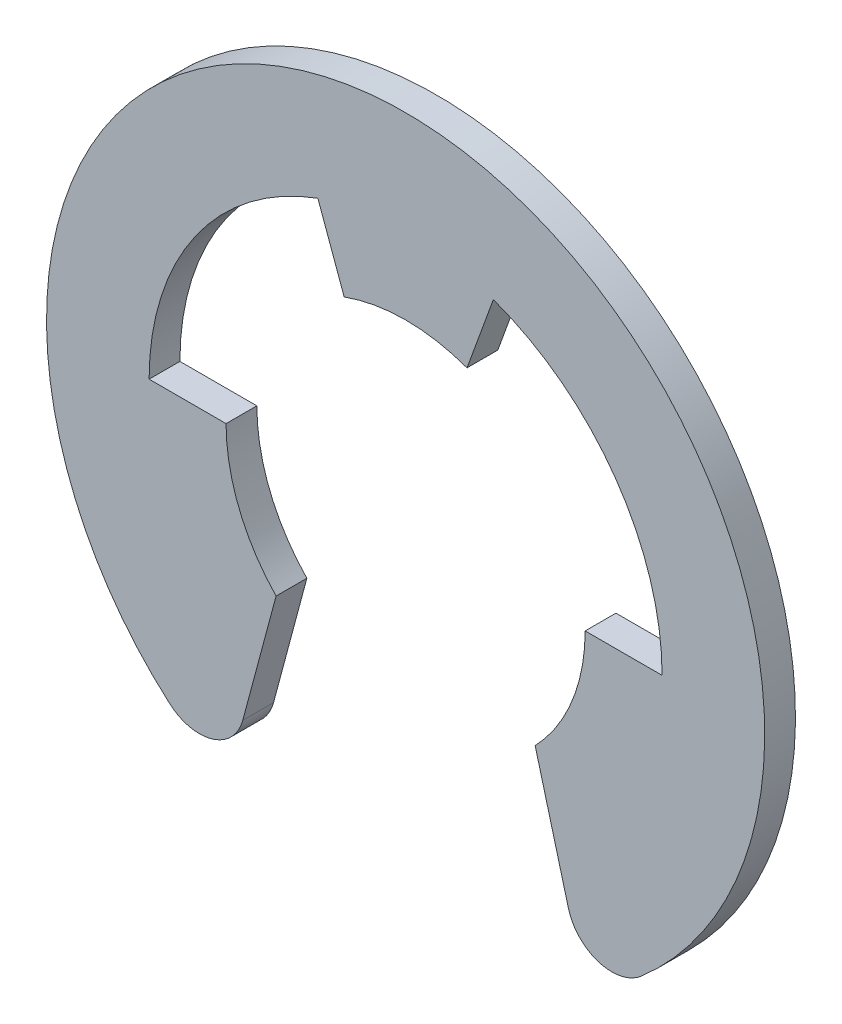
ISO-10303-21;
HEADER;
FILE_DESCRIPTION(('STEP AP214'),'2;1');
FILE_NAME('part.step','',(''),(''),'','','');
FILE_SCHEMA(('AUTOMOTIVE_DESIGN { 1 0 10303 214 1 1 1 1 }'));
ENDSEC;
DATA;
#1=APPLICATION_CONTEXT('core data for automotive mechanical design processes');
#2=APPLICATION_PROTOCOL_DEFINITION('international standard','automotive_design',2000,#1);
#3=PRODUCT_CONTEXT('',#1,'mechanical');
#4=PRODUCT('Part','Part','',(#3));
#5=PRODUCT_RELATED_PRODUCT_CATEGORY('part','',(#4));
#6=PRODUCT_DEFINITION_FORMATION('','',#4);
#7=PRODUCT_DEFINITION_CONTEXT('part definition',#1,'design');
#8=PRODUCT_DEFINITION('design','',#6,#7);
#9=PRODUCT_DEFINITION_SHAPE('','',#8);
#10=(LENGTH_UNIT() NAMED_UNIT(*) SI_UNIT(.MILLI.,.METRE.));
#11=(NAMED_UNIT(*) PLANE_ANGLE_UNIT() SI_UNIT($,.RADIAN.));
#12=(NAMED_UNIT(*) SI_UNIT($,.STERADIAN.) SOLID_ANGLE_UNIT());
#13=UNCERTAINTY_MEASURE_WITH_UNIT(LENGTH_MEASURE(1.E-05),#10,'distance_accuracy_value','');
#14=(GEOMETRIC_REPRESENTATION_CONTEXT(3) GLOBAL_UNCERTAINTY_ASSIGNED_CONTEXT((#13)) GLOBAL_UNIT_ASSIGNED_CONTEXT((#10,
#11,#12)) REPRESENTATION_CONTEXT('',''));
#15=CARTESIAN_POINT('',(0.,0.,0.));
#16=DIRECTION('',(0.,0.,1.));
#17=DIRECTION('',(1.,0.,0.));
#18=AXIS2_PLACEMENT_3D('',#15,#16,#17);
#19=CARTESIAN_POINT('',(0.,0.,0.6));
#20=DIRECTION('',(0.,0.,-1.));
#21=DIRECTION('',(-1.,0.,0.));
#22=AXIS2_PLACEMENT_3D('',#19,#20,#21);
#23=CYLINDRICAL_SURFACE('',#22,5.);
#24=CARTESIAN_POINT('',(0.,0.,0.));
#25=DIRECTION('',(0.,0.,-1.));
#26=DIRECTION('',(1.,0.,0.));
#27=AXIS2_PLACEMENT_3D('',#24,#25,#26);
#28=CIRCLE('',#27,5.);
#29=CARTESIAN_POINT('',(1.71010071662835,4.69846310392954,0.));
#30=VERTEX_POINT('',#29);
#31=CARTESIAN_POINT('',(5.,0.,0.));
#32=VERTEX_POINT('',#31);
#33=EDGE_CURVE('E136',#30,#32,#28,.T.);
#34=ORIENTED_EDGE('',*,*,#33,.T.);
#35=DIRECTION('',(0.,0.,-1.));
#36=VECTOR('',#35,1.);
#37=CARTESIAN_POINT('',(5.,0.,0.6));
#38=LINE('',#37,#36);
#39=CARTESIAN_POINT('',(5.,0.,0.6));
#40=VERTEX_POINT('',#39);
#41=EDGE_CURVE('E11',#40,#32,#38,.T.);
#42=ORIENTED_EDGE('',*,*,#41,.F.);
#43=CARTESIAN_POINT('',(0.,0.,0.6));
#44=DIRECTION('',(0.,0.,-1.));
#45=DIRECTION('',(1.,0.,0.));
#46=AXIS2_PLACEMENT_3D('',#43,#44,#45);
#47=CIRCLE('',#46,5.);
#48=CARTESIAN_POINT('',(1.71010071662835,4.69846310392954,0.6));
#49=VERTEX_POINT('',#48);
#50=EDGE_CURVE('E175',#49,#40,#47,.T.);
#51=ORIENTED_EDGE('',*,*,#50,.F.);
#52=DIRECTION('',(0.,0.,-1.));
#53=VECTOR('',#52,1.);
#54=CARTESIAN_POINT('',(1.71010071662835,4.69846310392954,0.6));
#55=LINE('',#54,#53);
#56=EDGE_CURVE('E149',#49,#30,#55,.T.);
#57=ORIENTED_EDGE('',*,*,#56,.T.);
#58=EDGE_LOOP('',(#34,#42,#51,#57));
#59=FACE_BOUND('',#58,.T.);
#60=ADVANCED_FACE('F32',(#59),#23,.F.);
#61=CARTESIAN_POINT('',(3.5,0.,0.6));
#62=DIRECTION('',(0.,-1.,0.));
#63=DIRECTION('',(0.,0.,-1.));
#64=AXIS2_PLACEMENT_3D('',#61,#62,#63);
#65=PLANE('',#64);
#66=DIRECTION('',(-1.,0.,0.));
#67=VECTOR('',#66,1.);
#68=CARTESIAN_POINT('',(3.5,0.,0.));
#69=LINE('',#68,#67);
#70=CARTESIAN_POINT('',(3.5,0.,0.));
#71=VERTEX_POINT('',#70);
#72=EDGE_CURVE('E132',#32,#71,#69,.T.);
#73=ORIENTED_EDGE('',*,*,#72,.T.);
#74=DIRECTION('',(0.,0.,-1.));
#75=VECTOR('',#74,1.);
#76=CARTESIAN_POINT('',(3.5,0.,0.6));
#77=LINE('',#76,#75);
#78=CARTESIAN_POINT('',(3.5,0.,0.6));
#79=VERTEX_POINT('',#78);
#80=EDGE_CURVE('E39',#79,#71,#77,.T.);
#81=ORIENTED_EDGE('',*,*,#80,.F.);
#82=DIRECTION('',(-1.,0.,0.));
#83=VECTOR('',#82,1.);
#84=CARTESIAN_POINT('',(3.5,0.,0.6));
#85=LINE('',#84,#83);
#86=EDGE_CURVE('E145',#40,#79,#85,.T.);
#87=ORIENTED_EDGE('',*,*,#86,.F.);
#88=ORIENTED_EDGE('',*,*,#41,.T.);
#89=EDGE_LOOP('',(#73,#81,#87,#88));
#90=FACE_BOUND('',#89,.T.);
#91=ADVANCED_FACE('F144',(#90),#65,.F.);
#92=CARTESIAN_POINT('',(0.,0.,0.6));
#93=DIRECTION('',(0.,0.,-1.));
#94=DIRECTION('',(-1.,0.,0.));
#95=AXIS2_PLACEMENT_3D('',#92,#93,#94);
#96=CYLINDRICAL_SURFACE('',#95,3.5);
#97=CARTESIAN_POINT('',(0.,0.,0.));
#98=DIRECTION('',(0.,0.,-1.));
#99=DIRECTION('',(1.,0.,0.));
#100=AXIS2_PLACEMENT_3D('',#97,#98,#99);
#101=CIRCLE('',#100,3.5);
#102=CARTESIAN_POINT('',(2.52505922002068,-2.4236493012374,0.));
#103=VERTEX_POINT('',#102);
#104=EDGE_CURVE('E138',#71,#103,#101,.T.);
#105=ORIENTED_EDGE('',*,*,#104,.T.);
#106=DIRECTION('',(0.,0.,-1.));
#107=VECTOR('',#106,1.);
#108=CARTESIAN_POINT('',(2.52505922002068,-2.4236493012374,0.6));
#109=LINE('',#108,#107);
#110=CARTESIAN_POINT('',(2.52505922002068,-2.4236493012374,0.6));
#111=VERTEX_POINT('',#110);
#112=EDGE_CURVE('E231',#111,#103,#109,.T.);
#113=ORIENTED_EDGE('',*,*,#112,.F.);
#114=CARTESIAN_POINT('',(0.,0.,0.6));
#115=DIRECTION('',(0.,0.,-1.));
#116=DIRECTION('',(1.,0.,0.));
#117=AXIS2_PLACEMENT_3D('',#114,#115,#116);
#118=CIRCLE('',#117,3.5);
#119=EDGE_CURVE('E178',#79,#111,#118,.T.);
#120=ORIENTED_EDGE('',*,*,#119,.F.);
#121=ORIENTED_EDGE('',*,*,#80,.T.);
#122=EDGE_LOOP('',(#105,#113,#120,#121));
#123=FACE_BOUND('',#122,.T.);
#124=ADVANCED_FACE('F235',(#123),#96,.F.);
#125=CARTESIAN_POINT('',(2.52505922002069,-2.4236493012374,0.6));
#126=DIRECTION('',(0.965925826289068,0.258819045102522,0.));
#127=DIRECTION('',(-0.258819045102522,0.965925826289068,0.));
#128=AXIS2_PLACEMENT_3D('',#125,#126,#127);
#129=PLANE('',#128);
#130=DIRECTION('',(0.258819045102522,-0.965925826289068,0.));
#131=VECTOR('',#130,1.);
#132=CARTESIAN_POINT('',(2.52505922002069,-2.4236493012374,0.));
#133=LINE('',#132,#131);
#134=CARTESIAN_POINT('',(3.17461227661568,-4.84781431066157,0.));
#135=VERTEX_POINT('',#134);
#136=EDGE_CURVE('E153',#103,#135,#133,.T.);
#137=ORIENTED_EDGE('',*,*,#136,.T.);
#138=DIRECTION('',(0.,0.,-1.));
#139=VECTOR('',#138,1.);
#140=CARTESIAN_POINT('',(3.17461227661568,-4.84781431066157,0.6));
#141=LINE('',#140,#139);
#142=CARTESIAN_POINT('',(3.17461227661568,-4.84781431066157,0.6));
#143=VERTEX_POINT('',#142);
#144=EDGE_CURVE('E228',#143,#135,#141,.T.);
#145=ORIENTED_EDGE('',*,*,#144,.F.);
#146=DIRECTION('',(0.258819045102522,-0.965925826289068,0.));
#147=VECTOR('',#146,1.);
#148=CARTESIAN_POINT('',(2.52505922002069,-2.4236493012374,0.6));
#149=LINE('',#148,#147);
#150=EDGE_CURVE('E180',#111,#143,#149,.T.);
#151=ORIENTED_EDGE('',*,*,#150,.F.);
#152=ORIENTED_EDGE('',*,*,#112,.T.);
#153=EDGE_LOOP('',(#137,#145,#151,#152));
#154=FACE_BOUND('',#153,.T.);
#155=ADVANCED_FACE('F243',(#154),#129,.F.);
#156=CARTESIAN_POINT('',(4.01979737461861,-4.62134764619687,0.6));
#157=DIRECTION('',(0.,0.,-1.));
#158=DIRECTION('',(-1.,0.,0.));
#159=AXIS2_PLACEMENT_3D('',#156,#157,#158);
#160=CYLINDRICAL_SURFACE('',#159,0.874999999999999);
#161=CARTESIAN_POINT('',(4.01979737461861,-4.62134764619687,0.));
#162=DIRECTION('',(0.,0.,1.));
#163=DIRECTION('',(1.,0.,0.));
#164=AXIS2_PLACEMENT_3D('',#161,#162,#163);
#165=CIRCLE('',#164,0.874999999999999);
#166=CARTESIAN_POINT('',(4.59405414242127,-5.28154016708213,0.));
#167=VERTEX_POINT('',#166);
#168=EDGE_CURVE('E155',#135,#167,#165,.T.);
#169=ORIENTED_EDGE('',*,*,#168,.T.);
#170=DIRECTION('',(0.,0.,-1.));
#171=VECTOR('',#170,1.);
#172=CARTESIAN_POINT('',(4.59405414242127,-5.28154016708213,0.6));
#173=LINE('',#172,#171);
#174=CARTESIAN_POINT('',(4.59405414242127,-5.28154016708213,0.6));
#175=VERTEX_POINT('',#174);
#176=EDGE_CURVE('E225',#175,#167,#173,.T.);
#177=ORIENTED_EDGE('',*,*,#176,.F.);
#178=CARTESIAN_POINT('',(4.01979737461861,-4.62134764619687,0.6));
#179=DIRECTION('',(0.,0.,1.));
#180=DIRECTION('',(1.,0.,0.));
#181=AXIS2_PLACEMENT_3D('',#178,#179,#180);
#182=CIRCLE('',#181,0.874999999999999);
#183=EDGE_CURVE('E182',#143,#175,#182,.T.);
#184=ORIENTED_EDGE('',*,*,#183,.F.);
#185=ORIENTED_EDGE('',*,*,#144,.T.);
#186=EDGE_LOOP('',(#169,#177,#184,#185));
#187=FACE_BOUND('',#186,.T.);
#188=ADVANCED_FACE('F246',(#187),#160,.T.);
#189=CARTESIAN_POINT('',(0.,0.,0.6));
#190=DIRECTION('',(0.,0.,-1.));
#191=DIRECTION('',(-1.,0.,0.));
#192=AXIS2_PLACEMENT_3D('',#189,#190,#191);
#193=CYLINDRICAL_SURFACE('',#192,7.);
#194=CARTESIAN_POINT('',(0.,0.,0.));
#195=DIRECTION('',(0.,0.,1.));
#196=DIRECTION('',(1.,0.,0.));
#197=AXIS2_PLACEMENT_3D('',#194,#195,#196);
#198=CIRCLE('',#197,7.);
#199=CARTESIAN_POINT('',(-4.59405414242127,-5.28154016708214,0.));
#200=VERTEX_POINT('',#199);
#201=EDGE_CURVE('E157',#167,#200,#198,.T.);
#202=ORIENTED_EDGE('',*,*,#201,.T.);
#203=DIRECTION('',(0.,0.,-1.));
#204=VECTOR('',#203,1.);
#205=CARTESIAN_POINT('',(-4.59405414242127,-5.28154016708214,0.6));
#206=LINE('',#205,#204);
#207=CARTESIAN_POINT('',(-4.59405414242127,-5.28154016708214,0.6));
#208=VERTEX_POINT('',#207);
#209=EDGE_CURVE('E222',#208,#200,#206,.T.);
#210=ORIENTED_EDGE('',*,*,#209,.F.);
#211=CARTESIAN_POINT('',(0.,0.,0.6));
#212=DIRECTION('',(0.,0.,1.));
#213=DIRECTION('',(1.,0.,0.));
#214=AXIS2_PLACEMENT_3D('',#211,#212,#213);
#215=CIRCLE('',#214,7.);
#216=EDGE_CURVE('E184',#175,#208,#215,.T.);
#217=ORIENTED_EDGE('',*,*,#216,.F.);
#218=ORIENTED_EDGE('',*,*,#176,.T.);
#219=EDGE_LOOP('',(#202,#210,#217,#218));
#220=FACE_BOUND('',#219,.T.);
#221=ADVANCED_FACE('F251',(#220),#193,.T.);
#222=CARTESIAN_POINT('',(-4.01979737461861,-4.62134764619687,0.6));
#223=DIRECTION('',(0.,0.,-1.));
#224=DIRECTION('',(-1.,0.,0.));
#225=AXIS2_PLACEMENT_3D('',#222,#223,#224);
#226=CYLINDRICAL_SURFACE('',#225,0.875);
#227=CARTESIAN_POINT('',(-4.01979737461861,-4.62134764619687,0.));
#228=DIRECTION('',(0.,0.,1.));
#229=DIRECTION('',(1.,0.,0.));
#230=AXIS2_PLACEMENT_3D('',#227,#228,#229);
#231=CIRCLE('',#230,0.875);
#232=CARTESIAN_POINT('',(-3.17461227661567,-4.84781431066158,0.));
#233=VERTEX_POINT('',#232);
#234=EDGE_CURVE('E159',#200,#233,#231,.T.);
#235=ORIENTED_EDGE('',*,*,#234,.T.);
#236=DIRECTION('',(0.,0.,-1.));
#237=VECTOR('',#236,1.);
#238=CARTESIAN_POINT('',(-3.17461227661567,-4.84781431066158,0.6));
#239=LINE('',#238,#237);
#240=CARTESIAN_POINT('',(-3.17461227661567,-4.84781431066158,0.6));
#241=VERTEX_POINT('',#240);
#242=EDGE_CURVE('E219',#241,#233,#239,.T.);
#243=ORIENTED_EDGE('',*,*,#242,.F.);
#244=CARTESIAN_POINT('',(-4.01979737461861,-4.62134764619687,0.6));
#245=DIRECTION('',(0.,0.,1.));
#246=DIRECTION('',(1.,0.,0.));
#247=AXIS2_PLACEMENT_3D('',#244,#245,#246);
#248=CIRCLE('',#247,0.875);
#249=EDGE_CURVE('E186',#208,#241,#248,.T.);
#250=ORIENTED_EDGE('',*,*,#249,.F.);
#251=ORIENTED_EDGE('',*,*,#209,.T.);
#252=EDGE_LOOP('',(#235,#243,#250,#251));
#253=FACE_BOUND('',#252,.T.);
#254=ADVANCED_FACE('F257',(#253),#226,.T.);
#255=CARTESIAN_POINT('',(-2.52505922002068,-2.4236493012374,0.6));
#256=DIRECTION('',(-0.965925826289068,0.258819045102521,0.));
#257=DIRECTION('',(-0.258819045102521,-0.965925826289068,0.));
#258=AXIS2_PLACEMENT_3D('',#255,#256,#257);
#259=PLANE('',#258);
#260=DIRECTION('',(0.258819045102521,0.965925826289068,0.));
#261=VECTOR('',#260,1.);
#262=CARTESIAN_POINT('',(-2.52505922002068,-2.4236493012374,0.));
#263=LINE('',#262,#261);
#264=CARTESIAN_POINT('',(-2.52505922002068,-2.4236493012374,0.));
#265=VERTEX_POINT('',#264);
#266=EDGE_CURVE('E161',#233,#265,#263,.T.);
#267=ORIENTED_EDGE('',*,*,#266,.T.);
#268=DIRECTION('',(0.,0.,-1.));
#269=VECTOR('',#268,1.);
#270=CARTESIAN_POINT('',(-2.52505922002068,-2.4236493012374,0.6));
#271=LINE('',#270,#269);
#272=CARTESIAN_POINT('',(-2.52505922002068,-2.4236493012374,0.6));
#273=VERTEX_POINT('',#272);
#274=EDGE_CURVE('E216',#273,#265,#271,.T.);
#275=ORIENTED_EDGE('',*,*,#274,.F.);
#276=DIRECTION('',(0.258819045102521,0.965925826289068,0.));
#277=VECTOR('',#276,1.);
#278=CARTESIAN_POINT('',(-2.52505922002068,-2.4236493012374,0.6));
#279=LINE('',#278,#277);
#280=EDGE_CURVE('E188',#241,#273,#279,.T.);
#281=ORIENTED_EDGE('',*,*,#280,.F.);
#282=ORIENTED_EDGE('',*,*,#242,.T.);
#283=EDGE_LOOP('',(#267,#275,#281,#282));
#284=FACE_BOUND('',#283,.T.);
#285=ADVANCED_FACE('F261',(#284),#259,.F.);
#286=CARTESIAN_POINT('',(0.,0.,0.6));
#287=DIRECTION('',(0.,0.,-1.));
#288=DIRECTION('',(-1.,0.,0.));
#289=AXIS2_PLACEMENT_3D('',#286,#287,#288);
#290=CYLINDRICAL_SURFACE('',#289,3.5);
#291=CARTESIAN_POINT('',(0.,0.,0.));
#292=DIRECTION('',(0.,0.,-1.));
#293=DIRECTION('',(1.,0.,0.));
#294=AXIS2_PLACEMENT_3D('',#291,#292,#293);
#295=CIRCLE('',#294,3.5);
#296=CARTESIAN_POINT('',(-3.5,0.,0.));
#297=VERTEX_POINT('',#296);
#298=EDGE_CURVE('E163',#265,#297,#295,.T.);
#299=ORIENTED_EDGE('',*,*,#298,.T.);
#300=DIRECTION('',(0.,0.,-1.));
#301=VECTOR('',#300,1.);
#302=CARTESIAN_POINT('',(-3.5,0.,0.6));
#303=LINE('',#302,#301);
#304=CARTESIAN_POINT('',(-3.5,0.,0.6));
#305=VERTEX_POINT('',#304);
#306=EDGE_CURVE('E213',#305,#297,#303,.T.);
#307=ORIENTED_EDGE('',*,*,#306,.F.);
#308=CARTESIAN_POINT('',(0.,0.,0.6));
#309=DIRECTION('',(0.,0.,-1.));
#310=DIRECTION('',(1.,0.,0.));
#311=AXIS2_PLACEMENT_3D('',#308,#309,#310);
#312=CIRCLE('',#311,3.5);
#313=EDGE_CURVE('E190',#273,#305,#312,.T.);
#314=ORIENTED_EDGE('',*,*,#313,.F.);
#315=ORIENTED_EDGE('',*,*,#274,.T.);
#316=EDGE_LOOP('',(#299,#307,#314,#315));
#317=FACE_BOUND('',#316,.T.);
#318=ADVANCED_FACE('F266',(#317),#290,.F.);
#319=CARTESIAN_POINT('',(-5.,0.,0.6));
#320=DIRECTION('',(0.,-1.,0.));
#321=DIRECTION('',(0.,0.,-1.));
#322=AXIS2_PLACEMENT_3D('',#319,#320,#321);
#323=PLANE('',#322);
#324=DIRECTION('',(-1.,0.,0.));
#325=VECTOR('',#324,1.);
#326=CARTESIAN_POINT('',(-5.,0.,0.));
#327=LINE('',#326,#325);
#328=CARTESIAN_POINT('',(-5.,0.,0.));
#329=VERTEX_POINT('',#328);
#330=EDGE_CURVE('E165',#297,#329,#327,.T.);
#331=ORIENTED_EDGE('',*,*,#330,.T.);
#332=DIRECTION('',(0.,0.,-1.));
#333=VECTOR('',#332,1.);
#334=CARTESIAN_POINT('',(-5.,0.,0.6));
#335=LINE('',#334,#333);
#336=CARTESIAN_POINT('',(-5.,0.,0.6));
#337=VERTEX_POINT('',#336);
#338=EDGE_CURVE('E210',#337,#329,#335,.T.);
#339=ORIENTED_EDGE('',*,*,#338,.F.);
#340=DIRECTION('',(-1.,0.,0.));
#341=VECTOR('',#340,1.);
#342=CARTESIAN_POINT('',(-5.,0.,0.6));
#343=LINE('',#342,#341);
#344=EDGE_CURVE('E192',#305,#337,#343,.T.);
#345=ORIENTED_EDGE('',*,*,#344,.F.);
#346=ORIENTED_EDGE('',*,*,#306,.T.);
#347=EDGE_LOOP('',(#331,#339,#345,#346));
#348=FACE_BOUND('',#347,.T.);
#349=ADVANCED_FACE('F272',(#348),#323,.F.);
#350=CARTESIAN_POINT('',(0.,0.,0.6));
#351=DIRECTION('',(0.,0.,-1.));
#352=DIRECTION('',(-1.,0.,0.));
#353=AXIS2_PLACEMENT_3D('',#350,#351,#352);
#354=CYLINDRICAL_SURFACE('',#353,5.);
#355=CARTESIAN_POINT('',(0.,0.,0.));
#356=DIRECTION('',(0.,0.,-1.));
#357=DIRECTION('',(1.,0.,0.));
#358=AXIS2_PLACEMENT_3D('',#355,#356,#357);
#359=CIRCLE('',#358,5.);
#360=CARTESIAN_POINT('',(-1.71010071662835,4.69846310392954,0.));
#361=VERTEX_POINT('',#360);
#362=EDGE_CURVE('E167',#329,#361,#359,.T.);
#363=ORIENTED_EDGE('',*,*,#362,.T.);
#364=DIRECTION('',(0.,0.,-1.));
#365=VECTOR('',#364,1.);
#366=CARTESIAN_POINT('',(-1.71010071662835,4.69846310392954,0.6));
#367=LINE('',#366,#365);
#368=CARTESIAN_POINT('',(-1.71010071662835,4.69846310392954,0.6));
#369=VERTEX_POINT('',#368);
#370=EDGE_CURVE('E207',#369,#361,#367,.T.);
#371=ORIENTED_EDGE('',*,*,#370,.F.);
#372=CARTESIAN_POINT('',(0.,0.,0.6));
#373=DIRECTION('',(0.,0.,-1.));
#374=DIRECTION('',(1.,0.,0.));
#375=AXIS2_PLACEMENT_3D('',#372,#373,#374);
#376=CIRCLE('',#375,5.);
#377=EDGE_CURVE('E194',#337,#369,#376,.T.);
#378=ORIENTED_EDGE('',*,*,#377,.F.);
#379=ORIENTED_EDGE('',*,*,#338,.T.);
#380=EDGE_LOOP('',(#363,#371,#378,#379));
#381=FACE_BOUND('',#380,.T.);
#382=ADVANCED_FACE('F276',(#381),#354,.F.);
#383=CARTESIAN_POINT('',(-1.19707050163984,3.28892417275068,0.6));
#384=DIRECTION('',(0.939692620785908,0.342020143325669,0.));
#385=DIRECTION('',(-0.342020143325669,0.939692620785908,0.));
#386=AXIS2_PLACEMENT_3D('',#383,#384,#385);
#387=PLANE('',#386);
#388=DIRECTION('',(0.342020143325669,-0.939692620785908,0.));
#389=VECTOR('',#388,1.);
#390=CARTESIAN_POINT('',(-1.19707050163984,3.28892417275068,0.));
#391=LINE('',#390,#389);
#392=CARTESIAN_POINT('',(-1.19707050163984,3.28892417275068,0.));
#393=VERTEX_POINT('',#392);
#394=EDGE_CURVE('E169',#361,#393,#391,.T.);
#395=ORIENTED_EDGE('',*,*,#394,.T.);
#396=DIRECTION('',(0.,0.,-1.));
#397=VECTOR('',#396,1.);
#398=CARTESIAN_POINT('',(-1.19707050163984,3.28892417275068,0.6));
#399=LINE('',#398,#397);
#400=CARTESIAN_POINT('',(-1.19707050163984,3.28892417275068,0.6));
#401=VERTEX_POINT('',#400);
#402=EDGE_CURVE('E204',#401,#393,#399,.T.);
#403=ORIENTED_EDGE('',*,*,#402,.F.);
#404=DIRECTION('',(0.342020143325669,-0.939692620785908,0.));
#405=VECTOR('',#404,1.);
#406=CARTESIAN_POINT('',(-1.19707050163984,3.28892417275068,0.6));
#407=LINE('',#406,#405);
#408=EDGE_CURVE('E196',#369,#401,#407,.T.);
#409=ORIENTED_EDGE('',*,*,#408,.F.);
#410=ORIENTED_EDGE('',*,*,#370,.T.);
#411=EDGE_LOOP('',(#395,#403,#409,#410));
#412=FACE_BOUND('',#411,.T.);
#413=ADVANCED_FACE('F281',(#412),#387,.F.);
#414=CARTESIAN_POINT('',(0.,0.,0.6));
#415=DIRECTION('',(0.,0.,-1.));
#416=DIRECTION('',(-1.,0.,0.));
#417=AXIS2_PLACEMENT_3D('',#414,#415,#416);
#418=CYLINDRICAL_SURFACE('',#417,3.5);
#419=CARTESIAN_POINT('',(0.,0.,0.));
#420=DIRECTION('',(0.,0.,-1.));
#421=DIRECTION('',(1.,0.,0.));
#422=AXIS2_PLACEMENT_3D('',#419,#420,#421);
#423=CIRCLE('',#422,3.5);
#424=CARTESIAN_POINT('',(1.19707050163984,3.28892417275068,0.));
#425=VERTEX_POINT('',#424);
#426=EDGE_CURVE('E171',#393,#425,#423,.T.);
#427=ORIENTED_EDGE('',*,*,#426,.T.);
#428=DIRECTION('',(0.,0.,-1.));
#429=VECTOR('',#428,1.);
#430=CARTESIAN_POINT('',(1.19707050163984,3.28892417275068,0.6));
#431=LINE('',#430,#429);
#432=CARTESIAN_POINT('',(1.19707050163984,3.28892417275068,0.6));
#433=VERTEX_POINT('',#432);
#434=EDGE_CURVE('E201',#433,#425,#431,.T.);
#435=ORIENTED_EDGE('',*,*,#434,.F.);
#436=CARTESIAN_POINT('',(0.,0.,0.6));
#437=DIRECTION('',(0.,0.,-1.));
#438=DIRECTION('',(1.,0.,0.));
#439=AXIS2_PLACEMENT_3D('',#436,#437,#438);
#440=CIRCLE('',#439,3.5);
#441=EDGE_CURVE('E51',#401,#433,#440,.T.);
#442=ORIENTED_EDGE('',*,*,#441,.F.);
#443=ORIENTED_EDGE('',*,*,#402,.T.);
#444=EDGE_LOOP('',(#427,#435,#442,#443));
#445=FACE_BOUND('',#444,.T.);
#446=ADVANCED_FACE('F284',(#445),#418,.F.);
#447=CARTESIAN_POINT('',(1.19707050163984,3.28892417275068,0.6));
#448=DIRECTION('',(-0.939692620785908,0.342020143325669,0.));
#449=DIRECTION('',(-0.342020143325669,-0.939692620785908,0.));
#450=AXIS2_PLACEMENT_3D('',#447,#448,#449);
#451=PLANE('',#450);
#452=DIRECTION('',(0.342020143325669,0.939692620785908,0.));
#453=VECTOR('',#452,1.);
#454=CARTESIAN_POINT('',(1.19707050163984,3.28892417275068,0.));
#455=LINE('',#454,#453);
#456=EDGE_CURVE('E173',#425,#30,#455,.T.);
#457=ORIENTED_EDGE('',*,*,#456,.T.);
#458=ORIENTED_EDGE('',*,*,#56,.F.);
#459=DIRECTION('',(0.342020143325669,0.939692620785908,0.));
#460=VECTOR('',#459,1.);
#461=CARTESIAN_POINT('',(1.19707050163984,3.28892417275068,0.6));
#462=LINE('',#461,#460);
#463=EDGE_CURVE('E46',#433,#49,#462,.T.);
#464=ORIENTED_EDGE('',*,*,#463,.F.);
#465=ORIENTED_EDGE('',*,*,#434,.T.);
#466=EDGE_LOOP('',(#457,#458,#464,#465));
#467=FACE_BOUND('',#466,.T.);
#468=ADVANCED_FACE('F286',(#467),#451,.F.);
#469=CARTESIAN_POINT('',(0.,0.,0.6));
#470=DIRECTION('',(0.,0.,1.));
#471=DIRECTION('',(1.,0.,0.));
#472=AXIS2_PLACEMENT_3D('',#469,#470,#471);
#473=PLANE('',#472);
#474=ORIENTED_EDGE('',*,*,#50,.T.);
#475=ORIENTED_EDGE('',*,*,#86,.T.);
#476=ORIENTED_EDGE('',*,*,#119,.T.);
#477=ORIENTED_EDGE('',*,*,#150,.T.);
#478=ORIENTED_EDGE('',*,*,#183,.T.);
#479=ORIENTED_EDGE('',*,*,#216,.T.);
#480=ORIENTED_EDGE('',*,*,#249,.T.);
#481=ORIENTED_EDGE('',*,*,#280,.T.);
#482=ORIENTED_EDGE('',*,*,#313,.T.);
#483=ORIENTED_EDGE('',*,*,#344,.T.);
#484=ORIENTED_EDGE('',*,*,#377,.T.);
#485=ORIENTED_EDGE('',*,*,#408,.T.);
#486=ORIENTED_EDGE('',*,*,#441,.T.);
#487=ORIENTED_EDGE('',*,*,#463,.T.);
#488=EDGE_LOOP('',(#474,#475,#476,#477,#478,#479,#480,#481,#482,#483,#484,#485,#486,#487));
#489=FACE_BOUND('',#488,.T.);
#490=ADVANCED_FACE('F238',(#489),#473,.T.);
#491=CARTESIAN_POINT('',(0.,0.,0.));
#492=DIRECTION('',(0.,0.,1.));
#493=DIRECTION('',(1.,0.,0.));
#494=AXIS2_PLACEMENT_3D('',#491,#492,#493);
#495=PLANE('',#494);
#496=ORIENTED_EDGE('',*,*,#33,.F.);
#497=ORIENTED_EDGE('',*,*,#456,.F.);
#498=ORIENTED_EDGE('',*,*,#426,.F.);
#499=ORIENTED_EDGE('',*,*,#394,.F.);
#500=ORIENTED_EDGE('',*,*,#362,.F.);
#501=ORIENTED_EDGE('',*,*,#330,.F.);
#502=ORIENTED_EDGE('',*,*,#298,.F.);
#503=ORIENTED_EDGE('',*,*,#266,.F.);
#504=ORIENTED_EDGE('',*,*,#234,.F.);
#505=ORIENTED_EDGE('',*,*,#201,.F.);
#506=ORIENTED_EDGE('',*,*,#168,.F.);
#507=ORIENTED_EDGE('',*,*,#136,.F.);
#508=ORIENTED_EDGE('',*,*,#104,.F.);
#509=ORIENTED_EDGE('',*,*,#72,.F.);
#510=EDGE_LOOP('',(#496,#497,#498,#499,#500,#501,#502,#503,#504,#505,#506,#507,#508,#509));
#511=FACE_BOUND('',#510,.T.);
#512=ADVANCED_FACE('F133',(#511),#495,.F.);
#513=CLOSED_SHELL('',(#60,#91,#124,#155,#188,#221,#254,#285,#318,#349,#382,#413,#446,#468,#490,#512));
#514=MANIFOLD_SOLID_BREP('B2',#513);
#515=ADVANCED_BREP_SHAPE_REPRESENTATION('',(#18,#514),#14);
#516=SHAPE_DEFINITION_REPRESENTATION(#9,#515);
ENDSEC;
END-ISO-10303-21;
